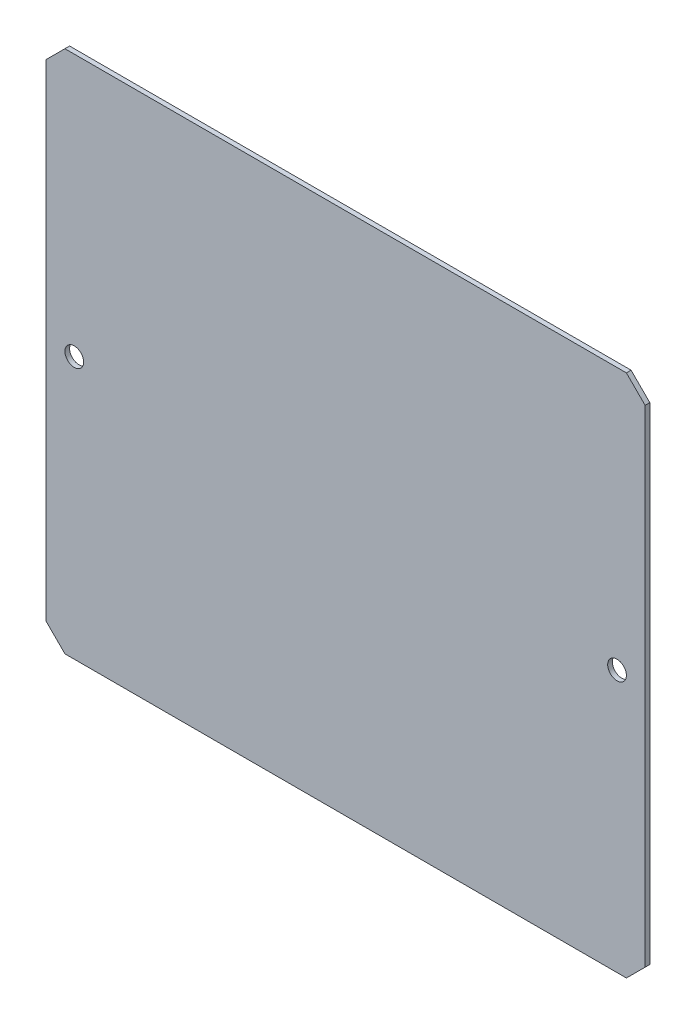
ISO-10303-21;
HEADER;
FILE_DESCRIPTION(('STEP AP214'),'2;1');
FILE_NAME('part.step','',(''),(''),'','','');
FILE_SCHEMA(('AUTOMOTIVE_DESIGN { 1 0 10303 214 1 1 1 1 }'));
ENDSEC;
DATA;
#1=APPLICATION_CONTEXT('core data for automotive mechanical design processes');
#2=APPLICATION_PROTOCOL_DEFINITION('international standard','automotive_design',2000,#1);
#3=PRODUCT_CONTEXT('',#1,'mechanical');
#4=PRODUCT('Part','Part','',(#3));
#5=PRODUCT_RELATED_PRODUCT_CATEGORY('part','',(#4));
#6=PRODUCT_DEFINITION_FORMATION('','',#4);
#7=PRODUCT_DEFINITION_CONTEXT('part definition',#1,'design');
#8=PRODUCT_DEFINITION('design','',#6,#7);
#9=PRODUCT_DEFINITION_SHAPE('','',#8);
#10=(LENGTH_UNIT() NAMED_UNIT(*) SI_UNIT(.MILLI.,.METRE.));
#11=(NAMED_UNIT(*) PLANE_ANGLE_UNIT() SI_UNIT($,.RADIAN.));
#12=(NAMED_UNIT(*) SI_UNIT($,.STERADIAN.) SOLID_ANGLE_UNIT());
#13=UNCERTAINTY_MEASURE_WITH_UNIT(LENGTH_MEASURE(1.E-05),#10,'distance_accuracy_value','');
#14=(GEOMETRIC_REPRESENTATION_CONTEXT(3) GLOBAL_UNCERTAINTY_ASSIGNED_CONTEXT((#13)) GLOBAL_UNIT_ASSIGNED_CONTEXT((#10,
#11,#12)) REPRESENTATION_CONTEXT('',''));
#15=CARTESIAN_POINT('',(0.,0.,0.));
#16=DIRECTION('',(0.,0.,1.));
#17=DIRECTION('',(1.,0.,0.));
#18=AXIS2_PLACEMENT_3D('',#15,#16,#17);
#19=CARTESIAN_POINT('',(-33.0996515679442,31.5951219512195,0.5));
#20=DIRECTION('',(1.,0.,0.));
#21=DIRECTION('',(0.,1.,0.));
#22=AXIS2_PLACEMENT_3D('',#19,#20,#21);
#23=PLANE('',#22);
#24=DIRECTION('',(0.,-1.,0.));
#25=VECTOR('',#24,1.);
#26=CARTESIAN_POINT('',(-33.0996515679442,31.5951219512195,0.));
#27=LINE('',#26,#25);
#28=CARTESIAN_POINT('',(-33.0996515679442,29.5951219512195,0.));
#29=VERTEX_POINT('',#28);
#30=CARTESIAN_POINT('',(-33.0996515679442,-22.4048780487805,0.));
#31=VERTEX_POINT('',#30);
#32=EDGE_CURVE('E106',#29,#31,#27,.T.);
#33=ORIENTED_EDGE('',*,*,#32,.T.);
#34=DIRECTION('',(0.,0.,1.));
#35=VECTOR('',#34,1.);
#36=CARTESIAN_POINT('',(-33.0996515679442,-22.4048780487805,0.5));
#37=LINE('',#36,#35);
#38=CARTESIAN_POINT('',(-33.0996515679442,-22.4048780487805,0.5));
#39=VERTEX_POINT('',#38);
#40=EDGE_CURVE('E39',#31,#39,#37,.T.);
#41=ORIENTED_EDGE('',*,*,#40,.T.);
#42=DIRECTION('',(0.,-1.,0.));
#43=VECTOR('',#42,1.);
#44=CARTESIAN_POINT('',(-33.0996515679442,31.5951219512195,0.5));
#45=LINE('',#44,#43);
#46=CARTESIAN_POINT('',(-33.0996515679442,29.5951219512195,0.5));
#47=VERTEX_POINT('',#46);
#48=EDGE_CURVE('E107',#47,#39,#45,.T.);
#49=ORIENTED_EDGE('',*,*,#48,.F.);
#50=DIRECTION('',(0.,0.,-1.));
#51=VECTOR('',#50,1.);
#52=CARTESIAN_POINT('',(-33.0996515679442,29.5951219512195,0.5));
#53=LINE('',#52,#51);
#54=EDGE_CURVE('E101',#47,#29,#53,.T.);
#55=ORIENTED_EDGE('',*,*,#54,.T.);
#56=EDGE_LOOP('',(#33,#41,#49,#55));
#57=FACE_BOUND('',#56,.T.);
#58=ADVANCED_FACE('F31',(#57),#23,.F.);
#59=CARTESIAN_POINT('',(-33.0996515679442,-24.4048780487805,0.5));
#60=DIRECTION('',(0.,1.,0.));
#61=DIRECTION('',(0.,0.,1.));
#62=AXIS2_PLACEMENT_3D('',#59,#60,#61);
#63=PLANE('',#62);
#64=DIRECTION('',(1.,0.,0.));
#65=VECTOR('',#64,1.);
#66=CARTESIAN_POINT('',(-33.0996515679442,-24.4048780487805,0.5));
#67=LINE('',#66,#65);
#68=CARTESIAN_POINT('',(-31.0996515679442,-24.4048780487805,0.5));
#69=VERTEX_POINT('',#68);
#70=CARTESIAN_POINT('',(28.9003484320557,-24.4048780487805,0.5));
#71=VERTEX_POINT('',#70);
#72=EDGE_CURVE('E156',#69,#71,#67,.T.);
#73=ORIENTED_EDGE('',*,*,#72,.F.);
#74=DIRECTION('',(0.,0.,-1.));
#75=VECTOR('',#74,1.);
#76=CARTESIAN_POINT('',(-31.0996515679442,-24.4048780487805,0.5));
#77=LINE('',#76,#75);
#78=CARTESIAN_POINT('',(-31.0996515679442,-24.4048780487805,0.));
#79=VERTEX_POINT('',#78);
#80=EDGE_CURVE('E149',#69,#79,#77,.T.);
#81=ORIENTED_EDGE('',*,*,#80,.T.);
#82=DIRECTION('',(1.,0.,0.));
#83=VECTOR('',#82,1.);
#84=CARTESIAN_POINT('',(-33.0996515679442,-24.4048780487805,0.));
#85=LINE('',#84,#83);
#86=CARTESIAN_POINT('',(28.9003484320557,-24.4048780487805,0.));
#87=VERTEX_POINT('',#86);
#88=EDGE_CURVE('E111',#79,#87,#85,.T.);
#89=ORIENTED_EDGE('',*,*,#88,.T.);
#90=DIRECTION('',(0.,0.,1.));
#91=VECTOR('',#90,1.);
#92=CARTESIAN_POINT('',(28.9003484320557,-24.4048780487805,0.5));
#93=LINE('',#92,#91);
#94=EDGE_CURVE('E146',#87,#71,#93,.T.);
#95=ORIENTED_EDGE('',*,*,#94,.T.);
#96=EDGE_LOOP('',(#73,#81,#89,#95));
#97=FACE_BOUND('',#96,.T.);
#98=ADVANCED_FACE('F155',(#97),#63,.F.);
#99=CARTESIAN_POINT('',(30.9003484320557,31.5951219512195,0.5));
#100=DIRECTION('',(-1.,0.,0.));
#101=DIRECTION('',(0.,-1.,0.));
#102=AXIS2_PLACEMENT_3D('',#99,#100,#101);
#103=PLANE('',#102);
#104=DIRECTION('',(0.,1.,0.));
#105=VECTOR('',#104,1.);
#106=CARTESIAN_POINT('',(30.9003484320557,31.5951219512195,0.));
#107=LINE('',#106,#105);
#108=CARTESIAN_POINT('',(30.9003484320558,-22.4048780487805,0.));
#109=VERTEX_POINT('',#108);
#110=CARTESIAN_POINT('',(30.9003484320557,29.5951219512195,0.));
#111=VERTEX_POINT('',#110);
#112=EDGE_CURVE('E114',#109,#111,#107,.T.);
#113=ORIENTED_EDGE('',*,*,#112,.T.);
#114=DIRECTION('',(0.,0.,1.));
#115=VECTOR('',#114,1.);
#116=CARTESIAN_POINT('',(30.9003484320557,29.5951219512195,0.5));
#117=LINE('',#116,#115);
#118=CARTESIAN_POINT('',(30.9003484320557,29.5951219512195,0.5));
#119=VERTEX_POINT('',#118);
#120=EDGE_CURVE('E140',#111,#119,#117,.T.);
#121=ORIENTED_EDGE('',*,*,#120,.T.);
#122=DIRECTION('',(0.,1.,0.));
#123=VECTOR('',#122,1.);
#124=CARTESIAN_POINT('',(30.9003484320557,31.5951219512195,0.5));
#125=LINE('',#124,#123);
#126=CARTESIAN_POINT('',(30.9003484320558,-22.4048780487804,0.5));
#127=VERTEX_POINT('',#126);
#128=EDGE_CURVE('E169',#127,#119,#125,.T.);
#129=ORIENTED_EDGE('',*,*,#128,.F.);
#130=DIRECTION('',(0.,0.,-1.));
#131=VECTOR('',#130,1.);
#132=CARTESIAN_POINT('',(30.9003484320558,-22.4048780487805,0.5));
#133=LINE('',#132,#131);
#134=EDGE_CURVE('E137',#127,#109,#133,.T.);
#135=ORIENTED_EDGE('',*,*,#134,.T.);
#136=EDGE_LOOP('',(#113,#121,#129,#135));
#137=FACE_BOUND('',#136,.T.);
#138=ADVANCED_FACE('F172',(#137),#103,.F.);
#139=CARTESIAN_POINT('',(-33.0996515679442,31.5951219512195,0.5));
#140=DIRECTION('',(0.,-1.,0.));
#141=DIRECTION('',(0.,0.,-1.));
#142=AXIS2_PLACEMENT_3D('',#139,#140,#141);
#143=PLANE('',#142);
#144=DIRECTION('',(-1.,0.,0.));
#145=VECTOR('',#144,1.);
#146=CARTESIAN_POINT('',(-33.0996515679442,31.5951219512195,0.5));
#147=LINE('',#146,#145);
#148=CARTESIAN_POINT('',(28.9003484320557,31.5951219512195,0.5));
#149=VERTEX_POINT('',#148);
#150=CARTESIAN_POINT('',(-31.0996515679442,31.5951219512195,0.5));
#151=VERTEX_POINT('',#150);
#152=EDGE_CURVE('E108',#149,#151,#147,.T.);
#153=ORIENTED_EDGE('',*,*,#152,.F.);
#154=DIRECTION('',(0.,0.,-1.));
#155=VECTOR('',#154,1.);
#156=CARTESIAN_POINT('',(28.9003484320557,31.5951219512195,0.5));
#157=LINE('',#156,#155);
#158=CARTESIAN_POINT('',(28.9003484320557,31.5951219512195,0.));
#159=VERTEX_POINT('',#158);
#160=EDGE_CURVE('E129',#149,#159,#157,.T.);
#161=ORIENTED_EDGE('',*,*,#160,.T.);
#162=DIRECTION('',(-1.,0.,0.));
#163=VECTOR('',#162,1.);
#164=CARTESIAN_POINT('',(-33.0996515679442,31.5951219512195,0.));
#165=LINE('',#164,#163);
#166=CARTESIAN_POINT('',(-31.0996515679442,31.5951219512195,0.));
#167=VERTEX_POINT('',#166);
#168=EDGE_CURVE('E124',#159,#167,#165,.T.);
#169=ORIENTED_EDGE('',*,*,#168,.T.);
#170=DIRECTION('',(0.,0.,1.));
#171=VECTOR('',#170,1.);
#172=CARTESIAN_POINT('',(-31.0996515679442,31.5951219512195,0.5));
#173=LINE('',#172,#171);
#174=EDGE_CURVE('E103',#167,#151,#173,.T.);
#175=ORIENTED_EDGE('',*,*,#174,.T.);
#176=EDGE_LOOP('',(#153,#161,#169,#175));
#177=FACE_BOUND('',#176,.T.);
#178=ADVANCED_FACE('F239',(#177),#143,.F.);
#179=CARTESIAN_POINT('',(-33.0996515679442,-24.4048780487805,0.5));
#180=DIRECTION('',(0.,0.,1.));
#181=DIRECTION('',(1.,0.,0.));
#182=AXIS2_PLACEMENT_3D('',#179,#180,#181);
#183=PLANE('',#182);
#184=CARTESIAN_POINT('',(-30.0996515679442,3.59512195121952,0.5));
#185=DIRECTION('',(0.,0.,1.));
#186=DIRECTION('',(1.,0.,0.));
#187=AXIS2_PLACEMENT_3D('',#184,#185,#186);
#188=CIRCLE('',#187,1.);
#189=CARTESIAN_POINT('',(-29.0996515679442,3.59512195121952,0.5));
#190=VERTEX_POINT('',#189);
#191=EDGE_CURVE('E179',#190,#190,#188,.T.);
#192=ORIENTED_EDGE('',*,*,#191,.F.);
#193=EDGE_LOOP('',(#192));
#194=FACE_BOUND('',#193,.T.);
#195=CARTESIAN_POINT('',(27.9003484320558,3.59512195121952,0.5));
#196=DIRECTION('',(0.,0.,1.));
#197=DIRECTION('',(1.,0.,0.));
#198=AXIS2_PLACEMENT_3D('',#195,#196,#197);
#199=CIRCLE('',#198,1.);
#200=CARTESIAN_POINT('',(28.9003484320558,3.59512195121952,0.5));
#201=VERTEX_POINT('',#200);
#202=EDGE_CURVE('E112',#201,#201,#199,.T.);
#203=ORIENTED_EDGE('',*,*,#202,.F.);
#204=EDGE_LOOP('',(#203));
#205=FACE_BOUND('',#204,.T.);
#206=ORIENTED_EDGE('',*,*,#48,.T.);
#207=DIRECTION('',(-0.707106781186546,0.707106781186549,0.));
#208=VECTOR('',#207,1.);
#209=CARTESIAN_POINT('',(-32.0996515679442,-23.4048780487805,0.5));
#210=LINE('',#209,#208);
#211=EDGE_CURVE('E11',#39,#69,#210,.F.);
#212=ORIENTED_EDGE('',*,*,#211,.T.);
#213=ORIENTED_EDGE('',*,*,#72,.T.);
#214=DIRECTION('',(-0.707106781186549,-0.707106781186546,0.));
#215=VECTOR('',#214,1.);
#216=CARTESIAN_POINT('',(-2.09965156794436,-55.4048780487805,0.5));
#217=LINE('',#216,#215);
#218=EDGE_CURVE('E142',#71,#127,#217,.F.);
#219=ORIENTED_EDGE('',*,*,#218,.T.);
#220=ORIENTED_EDGE('',*,*,#128,.T.);
#221=DIRECTION('',(0.707106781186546,-0.707106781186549,0.));
#222=VECTOR('',#221,1.);
#223=CARTESIAN_POINT('',(25.9003484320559,34.5951219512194,0.5));
#224=LINE('',#223,#222);
#225=EDGE_CURVE('E144',#119,#149,#224,.F.);
#226=ORIENTED_EDGE('',*,*,#225,.T.);
#227=ORIENTED_EDGE('',*,*,#152,.T.);
#228=DIRECTION('',(0.70710678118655,0.707106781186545,0.));
#229=VECTOR('',#228,1.);
#230=CARTESIAN_POINT('',(-60.0996515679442,2.59512195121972,0.5));
#231=LINE('',#230,#229);
#232=EDGE_CURVE('E127',#151,#47,#231,.F.);
#233=ORIENTED_EDGE('',*,*,#232,.T.);
#234=EDGE_LOOP('',(#206,#212,#213,#219,#220,#226,#227,#233));
#235=FACE_BOUND('',#234,.T.);
#236=ADVANCED_FACE('F168',(#194,#205,#235),#183,.T.);
#237=CARTESIAN_POINT('',(-33.0996515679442,-24.4048780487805,0.));
#238=DIRECTION('',(0.,0.,1.));
#239=DIRECTION('',(1.,0.,0.));
#240=AXIS2_PLACEMENT_3D('',#237,#238,#239);
#241=PLANE('',#240);
#242=CARTESIAN_POINT('',(-30.0996515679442,3.59512195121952,0.));
#243=DIRECTION('',(0.,0.,-1.));
#244=DIRECTION('',(-1.,0.,0.));
#245=AXIS2_PLACEMENT_3D('',#242,#243,#244);
#246=CIRCLE('',#245,1.);
#247=CARTESIAN_POINT('',(-31.0996515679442,3.59512195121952,0.));
#248=VERTEX_POINT('',#247);
#249=EDGE_CURVE('E182',#248,#248,#246,.T.);
#250=ORIENTED_EDGE('',*,*,#249,.F.);
#251=EDGE_LOOP('',(#250));
#252=FACE_BOUND('',#251,.T.);
#253=CARTESIAN_POINT('',(27.9003484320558,3.59512195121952,0.));
#254=DIRECTION('',(0.,0.,-1.));
#255=DIRECTION('',(-1.,0.,0.));
#256=AXIS2_PLACEMENT_3D('',#253,#254,#255);
#257=CIRCLE('',#256,1.);
#258=CARTESIAN_POINT('',(26.9003484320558,3.59512195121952,0.));
#259=VERTEX_POINT('',#258);
#260=EDGE_CURVE('E117',#259,#259,#257,.T.);
#261=ORIENTED_EDGE('',*,*,#260,.F.);
#262=EDGE_LOOP('',(#261));
#263=FACE_BOUND('',#262,.T.);
#264=ORIENTED_EDGE('',*,*,#88,.F.);
#265=DIRECTION('',(0.707106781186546,-0.707106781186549,0.));
#266=VECTOR('',#265,1.);
#267=CARTESIAN_POINT('',(-31.0996515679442,-24.4048780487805,0.));
#268=LINE('',#267,#266);
#269=EDGE_CURVE('E53',#79,#31,#268,.F.);
#270=ORIENTED_EDGE('',*,*,#269,.T.);
#271=ORIENTED_EDGE('',*,*,#32,.F.);
#272=DIRECTION('',(-0.70710678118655,-0.707106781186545,0.));
#273=VECTOR('',#272,1.);
#274=CARTESIAN_POINT('',(-33.0996515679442,29.5951219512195,0.));
#275=LINE('',#274,#273);
#276=EDGE_CURVE('E97',#29,#167,#275,.F.);
#277=ORIENTED_EDGE('',*,*,#276,.T.);
#278=ORIENTED_EDGE('',*,*,#168,.F.);
#279=DIRECTION('',(-0.707106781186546,0.707106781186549,0.));
#280=VECTOR('',#279,1.);
#281=CARTESIAN_POINT('',(28.9003484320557,31.5951219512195,0.));
#282=LINE('',#281,#280);
#283=EDGE_CURVE('E135',#159,#111,#282,.F.);
#284=ORIENTED_EDGE('',*,*,#283,.T.);
#285=ORIENTED_EDGE('',*,*,#112,.F.);
#286=DIRECTION('',(0.707106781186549,0.707106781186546,0.));
#287=VECTOR('',#286,1.);
#288=CARTESIAN_POINT('',(30.9003484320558,-22.4048780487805,0.));
#289=LINE('',#288,#287);
#290=EDGE_CURVE('E132',#109,#87,#289,.F.);
#291=ORIENTED_EDGE('',*,*,#290,.T.);
#292=EDGE_LOOP('',(#264,#270,#271,#277,#278,#284,#285,#291));
#293=FACE_BOUND('',#292,.T.);
#294=ADVANCED_FACE('F110',(#252,#263,#293),#241,.F.);
#295=CARTESIAN_POINT('',(-33.0996515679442,29.5951219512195,0.5));
#296=DIRECTION('',(0.707106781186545,-0.70710678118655,0.));
#297=DIRECTION('',(0.70710678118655,0.707106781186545,0.));
#298=AXIS2_PLACEMENT_3D('',#295,#296,#297);
#299=PLANE('',#298);
#300=ORIENTED_EDGE('',*,*,#232,.F.);
#301=ORIENTED_EDGE('',*,*,#174,.F.);
#302=ORIENTED_EDGE('',*,*,#276,.F.);
#303=ORIENTED_EDGE('',*,*,#54,.F.);
#304=EDGE_LOOP('',(#300,#301,#302,#303));
#305=FACE_BOUND('',#304,.T.);
#306=ADVANCED_FACE('F100',(#305),#299,.F.);
#307=CARTESIAN_POINT('',(28.9003484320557,31.5951219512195,0.5));
#308=DIRECTION('',(-0.707106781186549,-0.707106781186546,0.));
#309=DIRECTION('',(0.707106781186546,-0.707106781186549,0.));
#310=AXIS2_PLACEMENT_3D('',#307,#308,#309);
#311=PLANE('',#310);
#312=ORIENTED_EDGE('',*,*,#225,.F.);
#313=ORIENTED_EDGE('',*,*,#120,.F.);
#314=ORIENTED_EDGE('',*,*,#283,.F.);
#315=ORIENTED_EDGE('',*,*,#160,.F.);
#316=EDGE_LOOP('',(#312,#313,#314,#315));
#317=FACE_BOUND('',#316,.T.);
#318=ADVANCED_FACE('F214',(#317),#311,.F.);
#319=CARTESIAN_POINT('',(30.9003484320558,-22.4048780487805,0.5));
#320=DIRECTION('',(-0.707106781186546,0.707106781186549,0.));
#321=DIRECTION('',(-0.707106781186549,-0.707106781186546,0.));
#322=AXIS2_PLACEMENT_3D('',#319,#320,#321);
#323=PLANE('',#322);
#324=ORIENTED_EDGE('',*,*,#218,.F.);
#325=ORIENTED_EDGE('',*,*,#94,.F.);
#326=ORIENTED_EDGE('',*,*,#290,.F.);
#327=ORIENTED_EDGE('',*,*,#134,.F.);
#328=EDGE_LOOP('',(#324,#325,#326,#327));
#329=FACE_BOUND('',#328,.T.);
#330=ADVANCED_FACE('F164',(#329),#323,.F.);
#331=CARTESIAN_POINT('',(-31.0996515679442,-24.4048780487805,0.5));
#332=DIRECTION('',(0.707106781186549,0.707106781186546,0.));
#333=DIRECTION('',(-0.707106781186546,0.707106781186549,0.));
#334=AXIS2_PLACEMENT_3D('',#331,#332,#333);
#335=PLANE('',#334);
#336=ORIENTED_EDGE('',*,*,#211,.F.);
#337=ORIENTED_EDGE('',*,*,#40,.F.);
#338=ORIENTED_EDGE('',*,*,#269,.F.);
#339=ORIENTED_EDGE('',*,*,#80,.F.);
#340=EDGE_LOOP('',(#336,#337,#338,#339));
#341=FACE_BOUND('',#340,.T.);
#342=ADVANCED_FACE('F33',(#341),#335,.F.);
#343=CARTESIAN_POINT('',(27.9003484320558,3.59512195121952,10.));
#344=DIRECTION('',(0.,0.,-1.));
#345=DIRECTION('',(-1.,0.,0.));
#346=AXIS2_PLACEMENT_3D('',#343,#344,#345);
#347=CYLINDRICAL_SURFACE('',#346,1.);
#348=ORIENTED_EDGE('',*,*,#202,.T.);
#349=EDGE_LOOP('',(#348));
#350=FACE_BOUND('',#349,.T.);
#351=ORIENTED_EDGE('',*,*,#260,.T.);
#352=EDGE_LOOP('',(#351));
#353=FACE_BOUND('',#352,.T.);
#354=ADVANCED_FACE('F193',(#350,#353),#347,.F.);
#355=CARTESIAN_POINT('',(-30.0996515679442,3.59512195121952,10.));
#356=DIRECTION('',(0.,0.,-1.));
#357=DIRECTION('',(-1.,0.,0.));
#358=AXIS2_PLACEMENT_3D('',#355,#356,#357);
#359=CYLINDRICAL_SURFACE('',#358,1.);
#360=ORIENTED_EDGE('',*,*,#191,.T.);
#361=EDGE_LOOP('',(#360));
#362=FACE_BOUND('',#361,.T.);
#363=ORIENTED_EDGE('',*,*,#249,.T.);
#364=EDGE_LOOP('',(#363));
#365=FACE_BOUND('',#364,.T.);
#366=ADVANCED_FACE('F186',(#362,#365),#359,.F.);
#367=CLOSED_SHELL('',(#58,#98,#138,#178,#236,#294,#306,#318,#330,#342,#354,#366));
#368=MANIFOLD_SOLID_BREP('B2',#367);
#369=ADVANCED_BREP_SHAPE_REPRESENTATION('',(#18,#368),#14);
#370=SHAPE_DEFINITION_REPRESENTATION(#9,#369);
ENDSEC;
END-ISO-10303-21;
